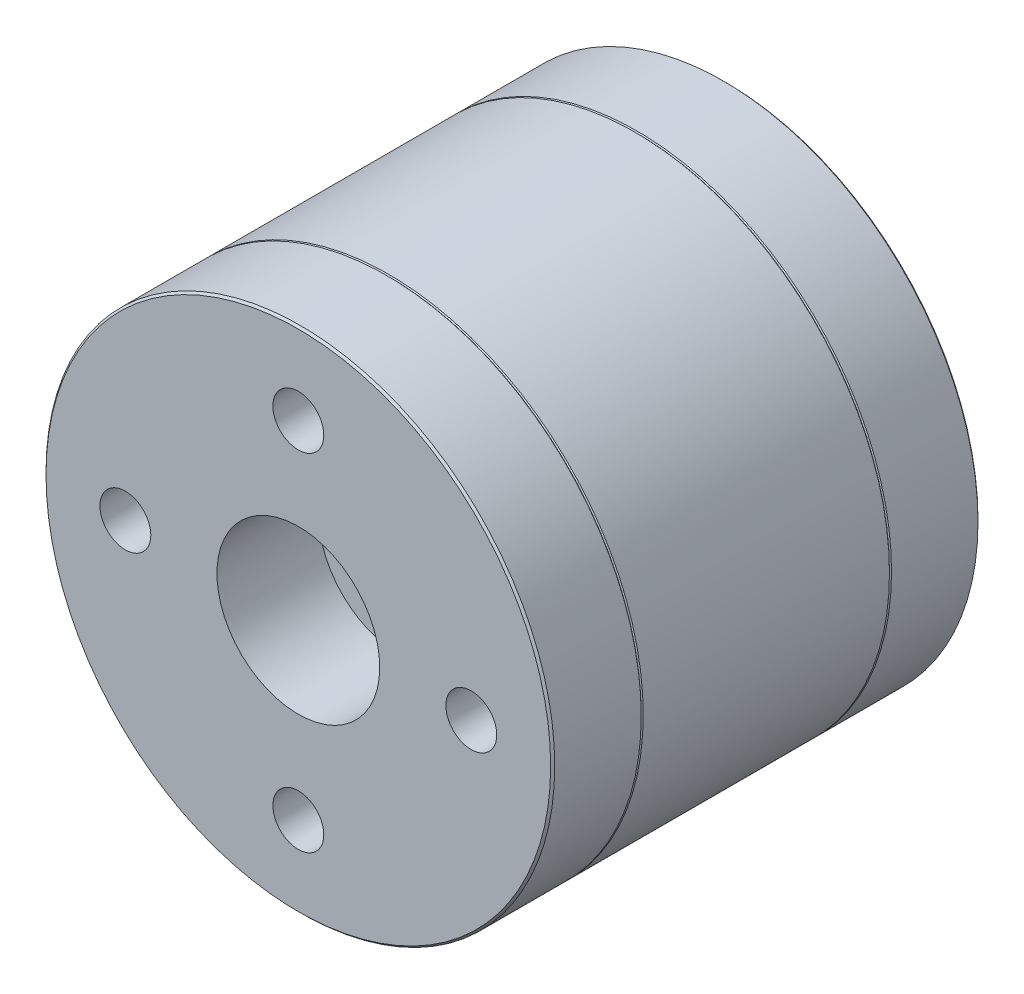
ISO-10303-21;
HEADER;
FILE_DESCRIPTION(('STEP AP214'),'2;1');
FILE_NAME('part.step','',(''),(''),'','','');
FILE_SCHEMA(('AUTOMOTIVE_DESIGN { 1 0 10303 214 1 1 1 1 }'));
ENDSEC;
DATA;
#1=APPLICATION_CONTEXT('core data for automotive mechanical design processes');
#2=APPLICATION_PROTOCOL_DEFINITION('international standard','automotive_design',2000,#1);
#3=PRODUCT_CONTEXT('',#1,'mechanical');
#4=PRODUCT('Part','Part','',(#3));
#5=PRODUCT_RELATED_PRODUCT_CATEGORY('part','',(#4));
#6=PRODUCT_DEFINITION_FORMATION('','',#4);
#7=PRODUCT_DEFINITION_CONTEXT('part definition',#1,'design');
#8=PRODUCT_DEFINITION('design','',#6,#7);
#9=PRODUCT_DEFINITION_SHAPE('','',#8);
#10=(LENGTH_UNIT() NAMED_UNIT(*) SI_UNIT(.MILLI.,.METRE.));
#11=(NAMED_UNIT(*) PLANE_ANGLE_UNIT() SI_UNIT($,.RADIAN.));
#12=(NAMED_UNIT(*) SI_UNIT($,.STERADIAN.) SOLID_ANGLE_UNIT());
#13=UNCERTAINTY_MEASURE_WITH_UNIT(LENGTH_MEASURE(1.E-05),#10,'distance_accuracy_value','');
#14=(GEOMETRIC_REPRESENTATION_CONTEXT(3) GLOBAL_UNCERTAINTY_ASSIGNED_CONTEXT((#13)) GLOBAL_UNIT_ASSIGNED_CONTEXT((#10,
#11,#12)) REPRESENTATION_CONTEXT('',''));
#15=CARTESIAN_POINT('',(0.,0.,0.));
#16=DIRECTION('',(0.,0.,1.));
#17=DIRECTION('',(1.,0.,0.));
#18=AXIS2_PLACEMENT_3D('',#15,#16,#17);
#19=CARTESIAN_POINT('',(-8.50000000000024,2.40543580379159E-13,10.501));
#20=DIRECTION('',(0.,0.,-1.));
#21=DIRECTION('',(-1.,0.,0.));
#22=AXIS2_PLACEMENT_3D('',#19,#20,#21);
#23=CYLINDRICAL_SURFACE('',#22,1.25000000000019);
#24=CARTESIAN_POINT('',(-8.50000000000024,2.40543580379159E-13,10.5));
#25=DIRECTION('',(0.,0.,1.));
#26=DIRECTION('',(1.,0.,0.));
#27=AXIS2_PLACEMENT_3D('',#24,#25,#26);
#28=CIRCLE('',#27,1.25000000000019);
#29=CARTESIAN_POINT('',(-7.25000000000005,2.40543580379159E-13,10.5));
#30=VERTEX_POINT('',#29);
#31=EDGE_CURVE('E126',#30,#30,#28,.F.);
#32=ORIENTED_EDGE('',*,*,#31,.F.);
#33=EDGE_LOOP('',(#32));
#34=FACE_BOUND('',#33,.T.);
#35=CARTESIAN_POINT('',(-8.50000000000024,2.40543580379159E-13,-7.5));
#36=DIRECTION('',(0.,0.,-1.));
#37=DIRECTION('',(-1.,0.,0.));
#38=AXIS2_PLACEMENT_3D('',#35,#36,#37);
#39=CIRCLE('',#38,1.25000000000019);
#40=CARTESIAN_POINT('',(-9.75000000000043,2.40543580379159E-13,-7.5));
#41=VERTEX_POINT('',#40);
#42=EDGE_CURVE('E54',#41,#41,#39,.F.);
#43=ORIENTED_EDGE('',*,*,#42,.F.);
#44=EDGE_LOOP('',(#43));
#45=FACE_BOUND('',#44,.T.);
#46=ADVANCED_FACE('F33',(#34,#45),#23,.F.);
#47=CARTESIAN_POINT('',(8.49999999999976,-2.41584530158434E-13,10.501));
#48=DIRECTION('',(0.,0.,-1.));
#49=DIRECTION('',(-1.,0.,0.));
#50=AXIS2_PLACEMENT_3D('',#47,#48,#49);
#51=CYLINDRICAL_SURFACE('',#50,1.25000000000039);
#52=CARTESIAN_POINT('',(8.49999999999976,-2.41584530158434E-13,10.5));
#53=DIRECTION('',(0.,0.,1.));
#54=DIRECTION('',(1.,0.,0.));
#55=AXIS2_PLACEMENT_3D('',#52,#53,#54);
#56=CIRCLE('',#55,1.25000000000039);
#57=CARTESIAN_POINT('',(9.75000000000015,-2.41584530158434E-13,10.5));
#58=VERTEX_POINT('',#57);
#59=EDGE_CURVE('E62',#58,#58,#56,.F.);
#60=ORIENTED_EDGE('',*,*,#59,.F.);
#61=EDGE_LOOP('',(#60));
#62=FACE_BOUND('',#61,.T.);
#63=CARTESIAN_POINT('',(8.49999999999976,-2.41584530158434E-13,-7.5));
#64=DIRECTION('',(0.,0.,-1.));
#65=DIRECTION('',(-1.,0.,0.));
#66=AXIS2_PLACEMENT_3D('',#63,#64,#65);
#67=CIRCLE('',#66,1.25000000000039);
#68=CARTESIAN_POINT('',(7.24999999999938,-2.41584530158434E-13,-7.5));
#69=VERTEX_POINT('',#68);
#70=EDGE_CURVE('E59',#69,#69,#67,.F.);
#71=ORIENTED_EDGE('',*,*,#70,.F.);
#72=EDGE_LOOP('',(#71));
#73=FACE_BOUND('',#72,.T.);
#74=ADVANCED_FACE('F161',(#62,#73),#51,.F.);
#75=CARTESIAN_POINT('',(0.,0.,10.501));
#76=DIRECTION('',(0.,0.,-1.));
#77=DIRECTION('',(-1.,0.,0.));
#78=AXIS2_PLACEMENT_3D('',#75,#76,#77);
#79=CYLINDRICAL_SURFACE('',#78,2.);
#80=CARTESIAN_POINT('',(0.,0.,-12.8));
#81=DIRECTION('',(0.,0.,-1.));
#82=DIRECTION('',(-1.,0.,0.));
#83=AXIS2_PLACEMENT_3D('',#80,#81,#82);
#84=CIRCLE('',#83,2.);
#85=CARTESIAN_POINT('',(-2.,0.,-12.8));
#86=VERTEX_POINT('',#85);
#87=EDGE_CURVE('E71',#86,#86,#84,.T.);
#88=ORIENTED_EDGE('',*,*,#87,.T.);
#89=EDGE_LOOP('',(#88));
#90=FACE_BOUND('',#89,.T.);
#91=CARTESIAN_POINT('',(0.,0.,5.5));
#92=DIRECTION('',(0.,0.,1.));
#93=DIRECTION('',(1.,0.,0.));
#94=AXIS2_PLACEMENT_3D('',#91,#92,#93);
#95=CIRCLE('',#94,2.);
#96=CARTESIAN_POINT('',(2.,0.,5.5));
#97=VERTEX_POINT('',#96);
#98=EDGE_CURVE('E75',#97,#97,#95,.F.);
#99=ORIENTED_EDGE('',*,*,#98,.F.);
#100=EDGE_LOOP('',(#99));
#101=FACE_BOUND('',#100,.T.);
#102=ADVANCED_FACE('F167',(#90,#101),#79,.F.);
#103=CARTESIAN_POINT('',(0.,0.,-9.5));
#104=DIRECTION('',(0.,0.,-1.));
#105=DIRECTION('',(-1.,0.,0.));
#106=AXIS2_PLACEMENT_3D('',#103,#104,#105);
#107=PLANE('',#106);
#108=CARTESIAN_POINT('',(0.,0.,-9.5));
#109=DIRECTION('',(0.,0.,-1.));
#110=DIRECTION('',(-1.,0.,0.));
#111=AXIS2_PLACEMENT_3D('',#108,#109,#110);
#112=CIRCLE('',#111,3.51);
#113=CARTESIAN_POINT('',(-3.51,0.,-9.5));
#114=VERTEX_POINT('',#113);
#115=EDGE_CURVE('E109',#114,#114,#112,.T.);
#116=ORIENTED_EDGE('',*,*,#115,.T.);
#117=EDGE_LOOP('',(#116));
#118=FACE_BOUND('',#117,.T.);
#119=CARTESIAN_POINT('',(0.,0.,-9.5));
#120=DIRECTION('',(0.,0.,-1.));
#121=DIRECTION('',(-1.,0.,0.));
#122=AXIS2_PLACEMENT_3D('',#119,#120,#121);
#123=CIRCLE('',#122,3.5);
#124=CARTESIAN_POINT('',(-3.5,0.,-9.5));
#125=VERTEX_POINT('',#124);
#126=EDGE_CURVE('E78',#125,#125,#123,.T.);
#127=ORIENTED_EDGE('',*,*,#126,.F.);
#128=EDGE_LOOP('',(#127));
#129=FACE_BOUND('',#128,.T.);
#130=ADVANCED_FACE('F192',(#118,#129),#107,.T.);
#131=CARTESIAN_POINT('',(0.,0.,10.5));
#132=DIRECTION('',(0.,0.,-1.));
#133=DIRECTION('',(-1.,0.,0.));
#134=AXIS2_PLACEMENT_3D('',#131,#132,#133);
#135=CYLINDRICAL_SURFACE('',#134,12.5);
#136=CARTESIAN_POINT('',(0.,0.,6.05));
#137=DIRECTION('',(0.,0.,1.));
#138=DIRECTION('',(1.,0.,0.));
#139=AXIS2_PLACEMENT_3D('',#136,#137,#138);
#140=CIRCLE('',#139,12.5);
#141=CARTESIAN_POINT('',(-12.5,0.,6.05));
#142=VERTEX_POINT('',#141);
#143=EDGE_CURVE('E94',#142,#142,#140,.T.);
#144=CARTESIAN_POINT('',(0.,0.,-6.05));
#145=DIRECTION('',(0.,0.,1.));
#146=DIRECTION('',(1.,0.,0.));
#147=AXIS2_PLACEMENT_3D('',#144,#145,#146);
#148=CIRCLE('',#147,12.5);
#149=CARTESIAN_POINT('',(-12.5,0.,-6.05000000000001));
#150=VERTEX_POINT('',#149);
#151=EDGE_CURVE('E106',#150,#150,#148,.T.);
#152=CARTESIAN_POINT('',(-12.5,0.,6.05));
#153=CARTESIAN_POINT('',(-12.5,0.,5.92395833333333));
#154=CARTESIAN_POINT('',(-12.5,0.,5.79791666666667));
#155=CARTESIAN_POINT('',(-12.5,0.,5.54583333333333));
#156=CARTESIAN_POINT('',(-12.5,0.,5.41979166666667));
#157=CARTESIAN_POINT('',(-12.5,0.,5.16770833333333));
#158=CARTESIAN_POINT('',(-12.5,0.,5.04166666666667));
#159=CARTESIAN_POINT('',(-12.5,0.,4.78958333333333));
#160=CARTESIAN_POINT('',(-12.5,0.,4.66354166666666));
#161=CARTESIAN_POINT('',(-12.5,0.,4.41145833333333));
#162=CARTESIAN_POINT('',(-12.5,0.,4.28541666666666));
#163=CARTESIAN_POINT('',(-12.5,0.,4.03333333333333));
#164=CARTESIAN_POINT('',(-12.5,0.,3.90729166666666));
#165=CARTESIAN_POINT('',(-12.5,0.,3.65520833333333));
#166=CARTESIAN_POINT('',(-12.5,0.,3.52916666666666));
#167=CARTESIAN_POINT('',(-12.5,0.,3.27708333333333));
#168=CARTESIAN_POINT('',(-12.5,0.,3.15104166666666));
#169=CARTESIAN_POINT('',(-12.5,0.,2.89895833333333));
#170=CARTESIAN_POINT('',(-12.5,0.,2.77291666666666));
#171=CARTESIAN_POINT('',(-12.5,0.,2.52083333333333));
#172=CARTESIAN_POINT('',(-12.5,0.,2.39479166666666));
#173=CARTESIAN_POINT('',(-12.5,0.,2.14270833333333));
#174=CARTESIAN_POINT('',(-12.5,0.,2.01666666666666));
#175=CARTESIAN_POINT('',(-12.5,0.,1.76458333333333));
#176=CARTESIAN_POINT('',(-12.5,0.,1.63854166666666));
#177=CARTESIAN_POINT('',(-12.5,0.,1.38645833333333));
#178=CARTESIAN_POINT('',(-12.5,0.,1.26041666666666));
#179=CARTESIAN_POINT('',(-12.5,0.,1.00833333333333));
#180=CARTESIAN_POINT('',(-12.5,0.,0.882291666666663));
#181=CARTESIAN_POINT('',(-12.5,0.,0.63020833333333));
#182=CARTESIAN_POINT('',(-12.5,0.,0.504166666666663));
#183=CARTESIAN_POINT('',(-12.5,0.,0.25208333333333));
#184=CARTESIAN_POINT('',(-12.5,0.,0.126041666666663));
#185=CARTESIAN_POINT('',(-12.5,0.,-0.12604166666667));
#186=CARTESIAN_POINT('',(-12.5,0.,-0.252083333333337));
#187=CARTESIAN_POINT('',(-12.5,0.,-0.50416666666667));
#188=CARTESIAN_POINT('',(-12.5,0.,-0.630208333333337));
#189=CARTESIAN_POINT('',(-12.5,0.,-0.88229166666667));
#190=CARTESIAN_POINT('',(-12.5,0.,-1.00833333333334));
#191=CARTESIAN_POINT('',(-12.5,0.,-1.26041666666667));
#192=CARTESIAN_POINT('',(-12.5,0.,-1.38645833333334));
#193=CARTESIAN_POINT('',(-12.5,0.,-1.63854166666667));
#194=CARTESIAN_POINT('',(-12.5,0.,-1.76458333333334));
#195=CARTESIAN_POINT('',(-12.5,0.,-2.01666666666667));
#196=CARTESIAN_POINT('',(-12.5,0.,-2.14270833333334));
#197=CARTESIAN_POINT('',(-12.5,0.,-2.39479166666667));
#198=CARTESIAN_POINT('',(-12.5,0.,-2.52083333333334));
#199=CARTESIAN_POINT('',(-12.5,0.,-2.77291666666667));
#200=CARTESIAN_POINT('',(-12.5,0.,-2.89895833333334));
#201=CARTESIAN_POINT('',(-12.5,0.,-3.15104166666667));
#202=CARTESIAN_POINT('',(-12.5,0.,-3.27708333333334));
#203=CARTESIAN_POINT('',(-12.5,0.,-3.52916666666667));
#204=CARTESIAN_POINT('',(-12.5,0.,-3.65520833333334));
#205=CARTESIAN_POINT('',(-12.5,0.,-3.90729166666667));
#206=CARTESIAN_POINT('',(-12.5,0.,-4.03333333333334));
#207=CARTESIAN_POINT('',(-12.5,0.,-4.28541666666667));
#208=CARTESIAN_POINT('',(-12.5,0.,-4.41145833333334));
#209=CARTESIAN_POINT('',(-12.5,0.,-4.66354166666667));
#210=CARTESIAN_POINT('',(-12.5,0.,-4.78958333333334));
#211=CARTESIAN_POINT('',(-12.5,0.,-5.04166666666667));
#212=CARTESIAN_POINT('',(-12.5,0.,-5.16770833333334));
#213=CARTESIAN_POINT('',(-12.5,0.,-5.41979166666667));
#214=CARTESIAN_POINT('',(-12.5,0.,-5.54583333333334));
#215=CARTESIAN_POINT('',(-12.5,0.,-5.79791666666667));
#216=CARTESIAN_POINT('',(-12.5,0.,-5.92395833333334));
#217=CARTESIAN_POINT('',(-12.5,0.,-6.05000000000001));
#218=B_SPLINE_CURVE_WITH_KNOTS('',3,(#152,#153,#154,#155,#156,#157,#158,#159,#160,#161,#162,
#163,#164,#165,#166,#167,#168,#169,#170,#171,#172,#173,#174,#175,#176,#177,#178,#179,#180,#181,
#182,#183,#184,#185,#186,#187,#188,#189,#190,#191,#192,#193,#194,#195,#196,#197,#198,#199,#200,
#201,#202,#203,#204,#205,#206,#207,#208,#209,#210,#211,#212,#213,#214,#215,#216,#217),
.UNSPECIFIED.,.F.,.F.,(4,2,2,2,2,2,2,2,2,2,2,2,2,2,2,2,2,2,2,2,2,2,2,2,2,2,2,2,2,2,2,2,4),(0.,
0.378125,0.75625,1.134375,1.5125,1.890625,2.26875,2.646875,3.025,3.403125,3.78125,4.159375,
4.5375,4.915625,5.29375,5.671875,6.05,6.428125,6.80625,7.184375,7.5625,7.940625,8.31875,
8.696875,9.075,9.453125,9.83125,10.209375,10.5875,10.965625,11.34375,11.721875,12.1),.UNSPECIFIED.);
#219=EDGE_CURVE('BSEAM204',#142,#150,#218,.T.);
#220=ORIENTED_EDGE('',*,*,#143,.F.);
#221=ORIENTED_EDGE('',*,*,#151,.T.);
#222=ORIENTED_EDGE('',*,*,#219,.T.);
#223=ORIENTED_EDGE('',*,*,#219,.F.);
#224=EDGE_LOOP('',(#220,#222,#221,#223));
#225=FACE_BOUND('',#224,.T.);
#226=ADVANCED_FACE('F204',(#225),#135,.T.);
#227=CARTESIAN_POINT('',(0.,0.,10.4));
#228=DIRECTION('',(0.,0.,1.));
#229=DIRECTION('',(1.,0.,0.));
#230=AXIS2_PLACEMENT_3D('',#227,#228,#229);
#231=CIRCLE('',#230,12.5);
#232=CARTESIAN_POINT('',(-12.5,0.,10.4));
#233=VERTEX_POINT('',#232);
#234=EDGE_CURVE('E85',#233,#233,#231,.F.);
#235=CARTESIAN_POINT('',(0.,0.,6.15));
#236=DIRECTION('',(0.,0.,1.));
#237=DIRECTION('',(1.,0.,0.));
#238=AXIS2_PLACEMENT_3D('',#235,#236,#237);
#239=CIRCLE('',#238,12.5);
#240=CARTESIAN_POINT('',(-12.5,0.,6.15));
#241=VERTEX_POINT('',#240);
#242=EDGE_CURVE('E97',#241,#241,#239,.T.);
#243=CARTESIAN_POINT('',(-12.5,0.,10.4));
#244=CARTESIAN_POINT('',(-12.5,0.,10.3557291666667));
#245=CARTESIAN_POINT('',(-12.5,0.,10.3114583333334));
#246=CARTESIAN_POINT('',(-12.5,0.,10.2229166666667));
#247=CARTESIAN_POINT('',(-12.5,0.,10.1786458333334));
#248=CARTESIAN_POINT('',(-12.5,0.,10.0901041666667));
#249=CARTESIAN_POINT('',(-12.5,0.,10.0458333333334));
#250=CARTESIAN_POINT('',(-12.5,0.,9.95729166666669));
#251=CARTESIAN_POINT('',(-12.5,0.,9.91302083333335));
#252=CARTESIAN_POINT('',(-12.5,0.,9.82447916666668));
#253=CARTESIAN_POINT('',(-12.5,0.,9.78020833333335));
#254=CARTESIAN_POINT('',(-12.5,0.,9.69166666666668));
#255=CARTESIAN_POINT('',(-12.5,0.,9.64739583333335));
#256=CARTESIAN_POINT('',(-12.5,0.,9.55885416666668));
#257=CARTESIAN_POINT('',(-12.5,0.,9.51458333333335));
#258=CARTESIAN_POINT('',(-12.5,0.,9.42604166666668));
#259=CARTESIAN_POINT('',(-12.5,0.,9.38177083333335));
#260=CARTESIAN_POINT('',(-12.5,0.,9.29322916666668));
#261=CARTESIAN_POINT('',(-12.5,0.,9.24895833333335));
#262=CARTESIAN_POINT('',(-12.5,0.,9.16041666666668));
#263=CARTESIAN_POINT('',(-12.5,0.,9.11614583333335));
#264=CARTESIAN_POINT('',(-12.5,0.,9.02760416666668));
#265=CARTESIAN_POINT('',(-12.5,0.,8.98333333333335));
#266=CARTESIAN_POINT('',(-12.5,0.,8.89479166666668));
#267=CARTESIAN_POINT('',(-12.5,0.,8.85052083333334));
#268=CARTESIAN_POINT('',(-12.5,0.,8.76197916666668));
#269=CARTESIAN_POINT('',(-12.5,0.,8.71770833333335));
#270=CARTESIAN_POINT('',(-12.5,0.,8.62916666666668));
#271=CARTESIAN_POINT('',(-12.5,0.,8.58489583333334));
#272=CARTESIAN_POINT('',(-12.5,0.,8.49635416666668));
#273=CARTESIAN_POINT('',(-12.5,0.,8.45208333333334));
#274=CARTESIAN_POINT('',(-12.5,0.,8.36354166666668));
#275=CARTESIAN_POINT('',(-12.5,0.,8.31927083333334));
#276=CARTESIAN_POINT('',(-12.5,0.,8.23072916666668));
#277=CARTESIAN_POINT('',(-12.5,0.,8.18645833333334));
#278=CARTESIAN_POINT('',(-12.5,0.,8.09791666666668));
#279=CARTESIAN_POINT('',(-12.5,0.,8.05364583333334));
#280=CARTESIAN_POINT('',(-12.5,0.,7.96510416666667));
#281=CARTESIAN_POINT('',(-12.5,0.,7.92083333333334));
#282=CARTESIAN_POINT('',(-12.5,0.,7.83229166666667));
#283=CARTESIAN_POINT('',(-12.5,0.,7.78802083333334));
#284=CARTESIAN_POINT('',(-12.5,0.,7.69947916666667));
#285=CARTESIAN_POINT('',(-12.5,0.,7.65520833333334));
#286=CARTESIAN_POINT('',(-12.5,0.,7.56666666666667));
#287=CARTESIAN_POINT('',(-12.5,0.,7.52239583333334));
#288=CARTESIAN_POINT('',(-12.5,0.,7.43385416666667));
#289=CARTESIAN_POINT('',(-12.5,0.,7.38958333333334));
#290=CARTESIAN_POINT('',(-12.5,0.,7.30104166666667));
#291=CARTESIAN_POINT('',(-12.5,0.,7.25677083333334));
#292=CARTESIAN_POINT('',(-12.5,0.,7.16822916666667));
#293=CARTESIAN_POINT('',(-12.5,0.,7.12395833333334));
#294=CARTESIAN_POINT('',(-12.5,0.,7.03541666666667));
#295=CARTESIAN_POINT('',(-12.5,0.,6.99114583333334));
#296=CARTESIAN_POINT('',(-12.5,0.,6.90260416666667));
#297=CARTESIAN_POINT('',(-12.5,0.,6.85833333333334));
#298=CARTESIAN_POINT('',(-12.5,0.,6.76979166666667));
#299=CARTESIAN_POINT('',(-12.5,0.,6.72552083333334));
#300=CARTESIAN_POINT('',(-12.5,0.,6.63697916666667));
#301=CARTESIAN_POINT('',(-12.5,0.,6.59270833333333));
#302=CARTESIAN_POINT('',(-12.5,0.,6.50416666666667));
#303=CARTESIAN_POINT('',(-12.5,0.,6.45989583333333));
#304=CARTESIAN_POINT('',(-12.5,0.,6.37135416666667));
#305=CARTESIAN_POINT('',(-12.5,0.,6.32708333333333));
#306=CARTESIAN_POINT('',(-12.5,0.,6.23854166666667));
#307=CARTESIAN_POINT('',(-12.5,0.,6.19427083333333));
#308=CARTESIAN_POINT('',(-12.5,0.,6.15));
#309=B_SPLINE_CURVE_WITH_KNOTS('',3,(#243,#244,#245,#246,#247,#248,#249,#250,#251,#252,#253,
#254,#255,#256,#257,#258,#259,#260,#261,#262,#263,#264,#265,#266,#267,#268,#269,#270,#271,#272,
#273,#274,#275,#276,#277,#278,#279,#280,#281,#282,#283,#284,#285,#286,#287,#288,#289,#290,#291,
#292,#293,#294,#295,#296,#297,#298,#299,#300,#301,#302,#303,#304,#305,#306,#307,#308),
.UNSPECIFIED.,.F.,.F.,(4,2,2,2,2,2,2,2,2,2,2,2,2,2,2,2,2,2,2,2,2,2,2,2,2,2,2,2,2,2,2,2,4),(0.,
0.132812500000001,0.265625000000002,0.398437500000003,0.531250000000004,0.664062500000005,
0.796875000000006,0.929687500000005,1.06250000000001,1.19531250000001,1.32812500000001,
1.46093750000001,1.59375000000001,1.72656250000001,1.85937500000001,1.99218750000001,
2.12500000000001,2.25781250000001,2.39062500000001,2.52343750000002,2.65625000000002,
2.78906250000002,2.92187500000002,3.05468750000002,3.18750000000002,3.32031250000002,
3.45312500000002,3.58593750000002,3.71875000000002,3.85156250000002,3.98437500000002,
4.11718750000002,4.25000000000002),.UNSPECIFIED.);
#310=EDGE_CURVE('BSEAM230',#233,#241,#309,.T.);
#311=ORIENTED_EDGE('',*,*,#234,.T.);
#312=ORIENTED_EDGE('',*,*,#242,.T.);
#313=ORIENTED_EDGE('',*,*,#310,.T.);
#314=ORIENTED_EDGE('',*,*,#310,.F.);
#315=EDGE_LOOP('',(#311,#313,#312,#314));
#316=FACE_BOUND('',#315,.T.);
#317=ADVANCED_FACE('F230',(#316),#135,.T.);
#318=CARTESIAN_POINT('',(0.,0.,10.5));
#319=DIRECTION('',(0.,0.,1.));
#320=DIRECTION('',(1.,0.,0.));
#321=AXIS2_PLACEMENT_3D('',#318,#319,#320);
#322=PLANE('',#321);
#323=ORIENTED_EDGE('',*,*,#59,.T.);
#324=EDGE_LOOP('',(#323));
#325=FACE_BOUND('',#324,.T.);
#326=CARTESIAN_POINT('',(-4.81087160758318E-13,-8.5,10.5));
#327=DIRECTION('',(0.,0.,1.));
#328=DIRECTION('',(1.,0.,0.));
#329=AXIS2_PLACEMENT_3D('',#326,#327,#328);
#330=CIRCLE('',#329,1.25000000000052);
#331=CARTESIAN_POINT('',(1.25000000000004,-8.5,10.5));
#332=VERTEX_POINT('',#331);
#333=EDGE_CURVE('E132',#332,#332,#330,.F.);
#334=ORIENTED_EDGE('',*,*,#333,.T.);
#335=EDGE_LOOP('',(#334));
#336=FACE_BOUND('',#335,.T.);
#337=ORIENTED_EDGE('',*,*,#31,.T.);
#338=EDGE_LOOP('',(#337));
#339=FACE_BOUND('',#338,.T.);
#340=CARTESIAN_POINT('',(0.,8.5,10.5));
#341=DIRECTION('',(0.,0.,1.));
#342=DIRECTION('',(1.,0.,0.));
#343=AXIS2_PLACEMENT_3D('',#340,#341,#342);
#344=CIRCLE('',#343,1.25);
#345=CARTESIAN_POINT('',(1.25,8.5,10.5));
#346=VERTEX_POINT('',#345);
#347=EDGE_CURVE('E123',#346,#346,#344,.F.);
#348=ORIENTED_EDGE('',*,*,#347,.T.);
#349=EDGE_LOOP('',(#348));
#350=FACE_BOUND('',#349,.T.);
#351=CARTESIAN_POINT('',(0.,0.,10.5));
#352=DIRECTION('',(0.,0.,1.));
#353=DIRECTION('',(1.,0.,0.));
#354=AXIS2_PLACEMENT_3D('',#351,#352,#353);
#355=CIRCLE('',#354,4.);
#356=CARTESIAN_POINT('',(4.,0.,10.5));
#357=VERTEX_POINT('',#356);
#358=EDGE_CURVE('E117',#357,#357,#355,.T.);
#359=ORIENTED_EDGE('',*,*,#358,.F.);
#360=EDGE_LOOP('',(#359));
#361=FACE_BOUND('',#360,.T.);
#362=CARTESIAN_POINT('',(0.,0.,10.5));
#363=DIRECTION('',(0.,0.,1.));
#364=DIRECTION('',(1.,0.,0.));
#365=AXIS2_PLACEMENT_3D('',#362,#363,#364);
#366=CIRCLE('',#365,12.4);
#367=CARTESIAN_POINT('',(12.4,0.,10.5));
#368=VERTEX_POINT('',#367);
#369=EDGE_CURVE('E88',#368,#368,#366,.T.);
#370=ORIENTED_EDGE('',*,*,#369,.T.);
#371=EDGE_LOOP('',(#370));
#372=FACE_BOUND('',#371,.T.);
#373=ADVANCED_FACE('F226',(#325,#336,#339,#350,#361,#372),#322,.T.);
#374=CARTESIAN_POINT('',(0.,0.,6.15));
#375=DIRECTION('',(0.,0.,1.));
#376=DIRECTION('',(1.,0.,0.));
#377=AXIS2_PLACEMENT_3D('',#374,#375,#376);
#378=CONICAL_SURFACE('',#377,12.5,0.785398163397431);
#379=CARTESIAN_POINT('',(0.,0.,6.1));
#380=DIRECTION('',(0.,0.,1.));
#381=DIRECTION('',(1.,0.,0.));
#382=AXIS2_PLACEMENT_3D('',#379,#380,#381);
#383=CIRCLE('',#382,12.45);
#384=CARTESIAN_POINT('',(12.45,0.,6.1));
#385=VERTEX_POINT('',#384);
#386=EDGE_CURVE('E91',#385,#385,#383,.T.);
#387=ORIENTED_EDGE('',*,*,#386,.T.);
#388=EDGE_LOOP('',(#387));
#389=FACE_BOUND('',#388,.T.);
#390=ORIENTED_EDGE('',*,*,#242,.F.);
#391=EDGE_LOOP('',(#390));
#392=FACE_BOUND('',#391,.T.);
#393=ADVANCED_FACE('F222',(#389,#392),#378,.T.);
#394=CARTESIAN_POINT('',(0.,0.,6.1));
#395=DIRECTION('',(0.,0.,-1.));
#396=DIRECTION('',(-1.,0.,0.));
#397=AXIS2_PLACEMENT_3D('',#394,#395,#396);
#398=CONICAL_SURFACE('',#397,12.45,0.785398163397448);
#399=ORIENTED_EDGE('',*,*,#143,.T.);
#400=EDGE_LOOP('',(#399));
#401=FACE_BOUND('',#400,.T.);
#402=ORIENTED_EDGE('',*,*,#386,.F.);
#403=EDGE_LOOP('',(#402));
#404=FACE_BOUND('',#403,.T.);
#405=ADVANCED_FACE('F218',(#401,#404),#398,.T.);
#406=CARTESIAN_POINT('',(0.,0.,-6.05));
#407=DIRECTION('',(0.,0.,1.));
#408=DIRECTION('',(1.,0.,0.));
#409=AXIS2_PLACEMENT_3D('',#406,#407,#408);
#410=CONICAL_SURFACE('',#409,12.5,0.785398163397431);
#411=CARTESIAN_POINT('',(0.,0.,-6.1));
#412=DIRECTION('',(0.,0.,1.));
#413=DIRECTION('',(1.,0.,0.));
#414=AXIS2_PLACEMENT_3D('',#411,#412,#413);
#415=CIRCLE('',#414,12.45);
#416=CARTESIAN_POINT('',(12.45,0.,-6.1));
#417=VERTEX_POINT('',#416);
#418=EDGE_CURVE('E100',#417,#417,#415,.T.);
#419=ORIENTED_EDGE('',*,*,#418,.T.);
#420=EDGE_LOOP('',(#419));
#421=FACE_BOUND('',#420,.T.);
#422=ORIENTED_EDGE('',*,*,#151,.F.);
#423=EDGE_LOOP('',(#422));
#424=FACE_BOUND('',#423,.T.);
#425=ADVANCED_FACE('F214',(#421,#424),#410,.T.);
#426=CARTESIAN_POINT('',(0.,0.,-6.1));
#427=DIRECTION('',(0.,0.,-1.));
#428=DIRECTION('',(-1.,0.,0.));
#429=AXIS2_PLACEMENT_3D('',#426,#427,#428);
#430=CONICAL_SURFACE('',#429,12.45,0.785398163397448);
#431=CARTESIAN_POINT('',(0.,0.,-6.15));
#432=DIRECTION('',(0.,0.,1.));
#433=DIRECTION('',(1.,0.,0.));
#434=AXIS2_PLACEMENT_3D('',#431,#432,#433);
#435=CIRCLE('',#434,12.5);
#436=CARTESIAN_POINT('',(-12.5,0.,-6.15));
#437=VERTEX_POINT('',#436);
#438=EDGE_CURVE('E103',#437,#437,#435,.T.);
#439=ORIENTED_EDGE('',*,*,#438,.T.);
#440=EDGE_LOOP('',(#439));
#441=FACE_BOUND('',#440,.T.);
#442=ORIENTED_EDGE('',*,*,#418,.F.);
#443=EDGE_LOOP('',(#442));
#444=FACE_BOUND('',#443,.T.);
#445=ADVANCED_FACE('F210',(#441,#444),#430,.T.);
#446=CARTESIAN_POINT('',(0.,0.,-10.5));
#447=DIRECTION('',(0.,0.,1.));
#448=DIRECTION('',(1.,0.,0.));
#449=AXIS2_PLACEMENT_3D('',#446,#447,#448);
#450=PLANE('',#449);
#451=CARTESIAN_POINT('',(-8.50000000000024,2.40543580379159E-13,-10.5));
#452=DIRECTION('',(0.,0.,1.));
#453=DIRECTION('',(1.,0.,0.));
#454=AXIS2_PLACEMENT_3D('',#451,#452,#453);
#455=CIRCLE('',#454,2.75000000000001);
#456=CARTESIAN_POINT('',(-5.75000000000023,2.40543580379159E-13,-10.5));
#457=VERTEX_POINT('',#456);
#458=EDGE_CURVE('E40',#457,#457,#455,.T.);
#459=ORIENTED_EDGE('',*,*,#458,.T.);
#460=EDGE_LOOP('',(#459));
#461=FACE_BOUND('',#460,.T.);
#462=CARTESIAN_POINT('',(8.49999999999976,-2.41584530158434E-13,-10.5));
#463=DIRECTION('',(0.,0.,1.));
#464=DIRECTION('',(1.,0.,0.));
#465=AXIS2_PLACEMENT_3D('',#462,#463,#464);
#466=CIRCLE('',#465,2.75);
#467=CARTESIAN_POINT('',(11.2499999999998,-2.41584530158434E-13,-10.5));
#468=VERTEX_POINT('',#467);
#469=EDGE_CURVE('E44',#468,#468,#466,.T.);
#470=ORIENTED_EDGE('',*,*,#469,.T.);
#471=EDGE_LOOP('',(#470));
#472=FACE_BOUND('',#471,.T.);
#473=CARTESIAN_POINT('',(-4.81087160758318E-13,-8.5,-10.5));
#474=DIRECTION('',(0.,0.,-1.));
#475=DIRECTION('',(-1.,0.,0.));
#476=AXIS2_PLACEMENT_3D('',#473,#474,#475);
#477=CIRCLE('',#476,1.25000000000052);
#478=CARTESIAN_POINT('',(-1.250000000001,-8.5,-10.5));
#479=VERTEX_POINT('',#478);
#480=EDGE_CURVE('E131',#479,#479,#477,.T.);
#481=ORIENTED_EDGE('',*,*,#480,.F.);
#482=EDGE_LOOP('',(#481));
#483=FACE_BOUND('',#482,.T.);
#484=CARTESIAN_POINT('',(0.,8.5,-10.5));
#485=DIRECTION('',(0.,0.,-1.));
#486=DIRECTION('',(-1.,0.,0.));
#487=AXIS2_PLACEMENT_3D('',#484,#485,#486);
#488=CIRCLE('',#487,1.25);
#489=CARTESIAN_POINT('',(-1.25,8.5,-10.5));
#490=VERTEX_POINT('',#489);
#491=EDGE_CURVE('E120',#490,#490,#488,.T.);
#492=ORIENTED_EDGE('',*,*,#491,.F.);
#493=EDGE_LOOP('',(#492));
#494=FACE_BOUND('',#493,.T.);
#495=CARTESIAN_POINT('',(0.,0.,-10.5));
#496=DIRECTION('',(0.,0.,-1.));
#497=DIRECTION('',(-1.,0.,0.));
#498=AXIS2_PLACEMENT_3D('',#495,#496,#497);
#499=CIRCLE('',#498,3.51);
#500=CARTESIAN_POINT('',(-3.51,0.,-10.5));
#501=VERTEX_POINT('',#500);
#502=EDGE_CURVE('E110',#501,#501,#499,.T.);
#503=ORIENTED_EDGE('',*,*,#502,.F.);
#504=EDGE_LOOP('',(#503));
#505=FACE_BOUND('',#504,.T.);
#506=CARTESIAN_POINT('',(0.,0.,-10.5));
#507=DIRECTION('',(0.,0.,1.));
#508=DIRECTION('',(1.,0.,0.));
#509=AXIS2_PLACEMENT_3D('',#506,#507,#508);
#510=CIRCLE('',#509,12.4);
#511=CARTESIAN_POINT('',(12.4,0.,-10.5));
#512=VERTEX_POINT('',#511);
#513=EDGE_CURVE('E74',#512,#512,#510,.F.);
#514=ORIENTED_EDGE('',*,*,#513,.T.);
#515=EDGE_LOOP('',(#514));
#516=FACE_BOUND('',#515,.T.);
#517=ADVANCED_FACE('F213',(#461,#472,#483,#494,#505,#516),#450,.F.);
#518=CARTESIAN_POINT('',(0.,0.,-10.4));
#519=DIRECTION('',(0.,0.,1.));
#520=DIRECTION('',(1.,0.,0.));
#521=AXIS2_PLACEMENT_3D('',#518,#519,#520);
#522=CIRCLE('',#521,12.5);
#523=CARTESIAN_POINT('',(-12.5,0.,-10.4));
#524=VERTEX_POINT('',#523);
#525=EDGE_CURVE('E82',#524,#524,#522,.T.);
#526=CARTESIAN_POINT('',(-12.5,0.,-10.4));
#527=CARTESIAN_POINT('',(-12.5,0.,-10.3557291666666));
#528=CARTESIAN_POINT('',(-12.5,0.,-10.3114583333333));
#529=CARTESIAN_POINT('',(-12.5,0.,-10.2229166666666));
#530=CARTESIAN_POINT('',(-12.5,0.,-10.1786458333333));
#531=CARTESIAN_POINT('',(-12.5,0.,-10.0901041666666));
#532=CARTESIAN_POINT('',(-12.5,0.,-10.0458333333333));
#533=CARTESIAN_POINT('',(-12.5,0.,-9.95729166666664));
#534=CARTESIAN_POINT('',(-12.5,0.,-9.91302083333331));
#535=CARTESIAN_POINT('',(-12.5,0.,-9.82447916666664));
#536=CARTESIAN_POINT('',(-12.5,0.,-9.78020833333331));
#537=CARTESIAN_POINT('',(-12.5,0.,-9.69166666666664));
#538=CARTESIAN_POINT('',(-12.5,0.,-9.64739583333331));
#539=CARTESIAN_POINT('',(-12.5,0.,-9.55885416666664));
#540=CARTESIAN_POINT('',(-12.5,0.,-9.51458333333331));
#541=CARTESIAN_POINT('',(-12.5,0.,-9.42604166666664));
#542=CARTESIAN_POINT('',(-12.5,0.,-9.38177083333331));
#543=CARTESIAN_POINT('',(-12.5,0.,-9.29322916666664));
#544=CARTESIAN_POINT('',(-12.5,0.,-9.24895833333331));
#545=CARTESIAN_POINT('',(-12.5,0.,-9.16041666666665));
#546=CARTESIAN_POINT('',(-12.5,0.,-9.11614583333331));
#547=CARTESIAN_POINT('',(-12.5,0.,-9.02760416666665));
#548=CARTESIAN_POINT('',(-12.5,0.,-8.98333333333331));
#549=CARTESIAN_POINT('',(-12.5,0.,-8.89479166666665));
#550=CARTESIAN_POINT('',(-12.5,0.,-8.85052083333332));
#551=CARTESIAN_POINT('',(-12.5,0.,-8.76197916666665));
#552=CARTESIAN_POINT('',(-12.5,0.,-8.71770833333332));
#553=CARTESIAN_POINT('',(-12.5,0.,-8.62916666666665));
#554=CARTESIAN_POINT('',(-12.5,0.,-8.58489583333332));
#555=CARTESIAN_POINT('',(-12.5,0.,-8.49635416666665));
#556=CARTESIAN_POINT('',(-12.5,0.,-8.45208333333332));
#557=CARTESIAN_POINT('',(-12.5,0.,-8.36354166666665));
#558=CARTESIAN_POINT('',(-12.5,0.,-8.31927083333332));
#559=CARTESIAN_POINT('',(-12.5,0.,-8.23072916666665));
#560=CARTESIAN_POINT('',(-12.5,0.,-8.18645833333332));
#561=CARTESIAN_POINT('',(-12.5,0.,-8.09791666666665));
#562=CARTESIAN_POINT('',(-12.5,0.,-8.05364583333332));
#563=CARTESIAN_POINT('',(-12.5,0.,-7.96510416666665));
#564=CARTESIAN_POINT('',(-12.5,0.,-7.92083333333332));
#565=CARTESIAN_POINT('',(-12.5,0.,-7.83229166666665));
#566=CARTESIAN_POINT('',(-12.5,0.,-7.78802083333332));
#567=CARTESIAN_POINT('',(-12.5,0.,-7.69947916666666));
#568=CARTESIAN_POINT('',(-12.5,0.,-7.65520833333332));
#569=CARTESIAN_POINT('',(-12.5,0.,-7.56666666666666));
#570=CARTESIAN_POINT('',(-12.5,0.,-7.52239583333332));
#571=CARTESIAN_POINT('',(-12.5,0.,-7.43385416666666));
#572=CARTESIAN_POINT('',(-12.5,0.,-7.38958333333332));
#573=CARTESIAN_POINT('',(-12.5,0.,-7.30104166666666));
#574=CARTESIAN_POINT('',(-12.5,0.,-7.25677083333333));
#575=CARTESIAN_POINT('',(-12.5,0.,-7.16822916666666));
#576=CARTESIAN_POINT('',(-12.5,0.,-7.12395833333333));
#577=CARTESIAN_POINT('',(-12.5,0.,-7.03541666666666));
#578=CARTESIAN_POINT('',(-12.5,0.,-6.99114583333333));
#579=CARTESIAN_POINT('',(-12.5,0.,-6.90260416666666));
#580=CARTESIAN_POINT('',(-12.5,0.,-6.85833333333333));
#581=CARTESIAN_POINT('',(-12.5,0.,-6.76979166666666));
#582=CARTESIAN_POINT('',(-12.5,0.,-6.72552083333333));
#583=CARTESIAN_POINT('',(-12.5,0.,-6.63697916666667));
#584=CARTESIAN_POINT('',(-12.5,0.,-6.59270833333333));
#585=CARTESIAN_POINT('',(-12.5,0.,-6.50416666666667));
#586=CARTESIAN_POINT('',(-12.5,0.,-6.45989583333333));
#587=CARTESIAN_POINT('',(-12.5,0.,-6.37135416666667));
#588=CARTESIAN_POINT('',(-12.5,0.,-6.32708333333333));
#589=CARTESIAN_POINT('',(-12.5,0.,-6.23854166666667));
#590=CARTESIAN_POINT('',(-12.5,0.,-6.19427083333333));
#591=CARTESIAN_POINT('',(-12.5,0.,-6.15));
#592=B_SPLINE_CURVE_WITH_KNOTS('',3,(#526,#527,#528,#529,#530,#531,#532,#533,#534,#535,#536,
#537,#538,#539,#540,#541,#542,#543,#544,#545,#546,#547,#548,#549,#550,#551,#552,#553,#554,#555,
#556,#557,#558,#559,#560,#561,#562,#563,#564,#565,#566,#567,#568,#569,#570,#571,#572,#573,#574,
#575,#576,#577,#578,#579,#580,#581,#582,#583,#584,#585,#586,#587,#588,#589,#590,#591),
.UNSPECIFIED.,.F.,.F.,(4,2,2,2,2,2,2,2,2,2,2,2,2,2,2,2,2,2,2,2,2,2,2,2,2,2,2,2,2,2,2,2,4),(0.,
0.132812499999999,0.265624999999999,0.398437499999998,0.531249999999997,0.664062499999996,
0.796874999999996,0.929687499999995,1.06249999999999,1.19531249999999,1.32812499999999,
1.46093749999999,1.59374999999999,1.72656249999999,1.85937499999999,1.99218749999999,
2.12499999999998,2.25781249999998,2.39062499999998,2.52343749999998,2.65624999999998,
2.78906249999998,2.92187499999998,3.05468749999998,3.18749999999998,3.32031249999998,
3.45312499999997,3.58593749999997,3.71874999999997,3.85156249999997,3.98437499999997,
4.11718749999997,4.24999999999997),.UNSPECIFIED.);
#593=EDGE_CURVE('BSEAM234',#524,#437,#592,.T.);
#594=ORIENTED_EDGE('',*,*,#525,.T.);
#595=ORIENTED_EDGE('',*,*,#438,.F.);
#596=ORIENTED_EDGE('',*,*,#593,.T.);
#597=ORIENTED_EDGE('',*,*,#593,.F.);
#598=EDGE_LOOP('',(#594,#596,#595,#597));
#599=FACE_BOUND('',#598,.T.);
#600=ADVANCED_FACE('F234',(#599),#135,.T.);
#601=CARTESIAN_POINT('',(0.,0.,10.5));
#602=DIRECTION('',(0.,0.,-1.));
#603=DIRECTION('',(-1.,0.,0.));
#604=AXIS2_PLACEMENT_3D('',#601,#602,#603);
#605=CONICAL_SURFACE('',#604,12.4,0.785398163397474);
#606=ORIENTED_EDGE('',*,*,#234,.F.);
#607=EDGE_LOOP('',(#606));
#608=FACE_BOUND('',#607,.T.);
#609=ORIENTED_EDGE('',*,*,#369,.F.);
#610=EDGE_LOOP('',(#609));
#611=FACE_BOUND('',#610,.T.);
#612=ADVANCED_FACE('F238',(#608,#611),#605,.T.);
#613=CARTESIAN_POINT('',(0.,0.,-10.4));
#614=DIRECTION('',(0.,0.,1.));
#615=DIRECTION('',(1.,0.,0.));
#616=AXIS2_PLACEMENT_3D('',#613,#614,#615);
#617=CONICAL_SURFACE('',#616,12.5,0.785398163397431);
#618=ORIENTED_EDGE('',*,*,#513,.F.);
#619=EDGE_LOOP('',(#618));
#620=FACE_BOUND('',#619,.T.);
#621=ORIENTED_EDGE('',*,*,#525,.F.);
#622=EDGE_LOOP('',(#621));
#623=FACE_BOUND('',#622,.T.);
#624=ADVANCED_FACE('F208',(#620,#623),#617,.T.);
#625=CARTESIAN_POINT('',(0.,0.,-9.5));
#626=DIRECTION('',(0.,0.,-1.));
#627=DIRECTION('',(-1.,0.,0.));
#628=AXIS2_PLACEMENT_3D('',#625,#626,#627);
#629=CYLINDRICAL_SURFACE('',#628,3.51);
#630=ORIENTED_EDGE('',*,*,#115,.F.);
#631=EDGE_LOOP('',(#630));
#632=FACE_BOUND('',#631,.T.);
#633=ORIENTED_EDGE('',*,*,#502,.T.);
#634=EDGE_LOOP('',(#633));
#635=FACE_BOUND('',#634,.T.);
#636=ADVANCED_FACE('F200',(#632,#635),#629,.F.);
#637=CARTESIAN_POINT('',(0.,0.,-13.));
#638=DIRECTION('',(0.,0.,1.));
#639=DIRECTION('',(1.,0.,0.));
#640=AXIS2_PLACEMENT_3D('',#637,#638,#639);
#641=CYLINDRICAL_SURFACE('',#640,3.5);
#642=CARTESIAN_POINT('',(0.,0.,-12.8));
#643=DIRECTION('',(0.,0.,-1.));
#644=DIRECTION('',(-1.,0.,0.));
#645=AXIS2_PLACEMENT_3D('',#642,#643,#644);
#646=CIRCLE('',#645,3.5);
#647=CARTESIAN_POINT('',(-3.5,0.,-12.8));
#648=VERTEX_POINT('',#647);
#649=EDGE_CURVE('E53',#648,#648,#646,.F.);
#650=ORIENTED_EDGE('',*,*,#649,.T.);
#651=EDGE_LOOP('',(#650));
#652=FACE_BOUND('',#651,.T.);
#653=ORIENTED_EDGE('',*,*,#126,.T.);
#654=EDGE_LOOP('',(#653));
#655=FACE_BOUND('',#654,.T.);
#656=ADVANCED_FACE('F196',(#652,#655),#641,.T.);
#657=CARTESIAN_POINT('',(0.,0.,-13.));
#658=DIRECTION('',(0.,0.,-1.));
#659=DIRECTION('',(-1.,0.,0.));
#660=AXIS2_PLACEMENT_3D('',#657,#658,#659);
#661=PLANE('',#660);
#662=CARTESIAN_POINT('',(0.,0.,-13.));
#663=DIRECTION('',(0.,0.,-1.));
#664=DIRECTION('',(-1.,0.,0.));
#665=AXIS2_PLACEMENT_3D('',#662,#663,#664);
#666=CIRCLE('',#665,2.2);
#667=CARTESIAN_POINT('',(-2.2,0.,-13.));
#668=VERTEX_POINT('',#667);
#669=EDGE_CURVE('E65',#668,#668,#666,.F.);
#670=ORIENTED_EDGE('',*,*,#669,.T.);
#671=EDGE_LOOP('',(#670));
#672=FACE_BOUND('',#671,.T.);
#673=CARTESIAN_POINT('',(0.,0.,-13.));
#674=DIRECTION('',(0.,0.,-1.));
#675=DIRECTION('',(-1.,0.,0.));
#676=AXIS2_PLACEMENT_3D('',#673,#674,#675);
#677=CIRCLE('',#676,3.30000000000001);
#678=CARTESIAN_POINT('',(-3.30000000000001,0.,-13.));
#679=VERTEX_POINT('',#678);
#680=EDGE_CURVE('E68',#679,#679,#677,.T.);
#681=ORIENTED_EDGE('',*,*,#680,.T.);
#682=EDGE_LOOP('',(#681));
#683=FACE_BOUND('',#682,.T.);
#684=ADVANCED_FACE('F184',(#672,#683),#661,.T.);
#685=CARTESIAN_POINT('',(0.,0.,5.5));
#686=DIRECTION('',(0.,0.,1.));
#687=DIRECTION('',(1.,0.,0.));
#688=AXIS2_PLACEMENT_3D('',#685,#686,#687);
#689=PLANE('',#688);
#690=CARTESIAN_POINT('',(0.,0.,5.5));
#691=DIRECTION('',(0.,0.,1.));
#692=DIRECTION('',(1.,0.,0.));
#693=AXIS2_PLACEMENT_3D('',#690,#691,#692);
#694=CIRCLE('',#693,4.);
#695=CARTESIAN_POINT('',(4.,0.,5.5));
#696=VERTEX_POINT('',#695);
#697=EDGE_CURVE('E79',#696,#696,#694,.T.);
#698=ORIENTED_EDGE('',*,*,#697,.T.);
#699=EDGE_LOOP('',(#698));
#700=FACE_BOUND('',#699,.T.);
#701=ORIENTED_EDGE('',*,*,#98,.T.);
#702=EDGE_LOOP('',(#701));
#703=FACE_BOUND('',#702,.T.);
#704=ADVANCED_FACE('F180',(#700,#703),#689,.T.);
#705=CARTESIAN_POINT('',(0.,0.,5.5));
#706=DIRECTION('',(0.,0.,1.));
#707=DIRECTION('',(1.,0.,0.));
#708=AXIS2_PLACEMENT_3D('',#705,#706,#707);
#709=CYLINDRICAL_SURFACE('',#708,4.);
#710=ORIENTED_EDGE('',*,*,#697,.F.);
#711=EDGE_LOOP('',(#710));
#712=FACE_BOUND('',#711,.T.);
#713=ORIENTED_EDGE('',*,*,#358,.T.);
#714=EDGE_LOOP('',(#713));
#715=FACE_BOUND('',#714,.T.);
#716=ADVANCED_FACE('F183',(#712,#715),#709,.F.);
#717=CARTESIAN_POINT('',(0.,0.,-12.8));
#718=DIRECTION('',(0.,0.,-1.));
#719=DIRECTION('',(-1.,0.,0.));
#720=AXIS2_PLACEMENT_3D('',#717,#718,#719);
#721=CONICAL_SURFACE('',#720,2.,0.785398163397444);
#722=ORIENTED_EDGE('',*,*,#669,.F.);
#723=EDGE_LOOP('',(#722));
#724=FACE_BOUND('',#723,.T.);
#725=ORIENTED_EDGE('',*,*,#87,.F.);
#726=EDGE_LOOP('',(#725));
#727=FACE_BOUND('',#726,.T.);
#728=ADVANCED_FACE('F188',(#724,#727),#721,.F.);
#729=CARTESIAN_POINT('',(0.,0.,-13.));
#730=DIRECTION('',(0.,0.,1.));
#731=DIRECTION('',(1.,0.,0.));
#732=AXIS2_PLACEMENT_3D('',#729,#730,#731);
#733=CONICAL_SURFACE('',#732,3.30000000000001,0.785398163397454);
#734=ORIENTED_EDGE('',*,*,#649,.F.);
#735=EDGE_LOOP('',(#734));
#736=FACE_BOUND('',#735,.T.);
#737=ORIENTED_EDGE('',*,*,#680,.F.);
#738=EDGE_LOOP('',(#737));
#739=FACE_BOUND('',#738,.T.);
#740=ADVANCED_FACE('F178',(#736,#739),#733,.T.);
#741=CARTESIAN_POINT('',(0.,8.5,10.501));
#742=DIRECTION('',(0.,0.,-1.));
#743=DIRECTION('',(-1.,0.,0.));
#744=AXIS2_PLACEMENT_3D('',#741,#742,#743);
#745=CYLINDRICAL_SURFACE('',#744,1.25);
#746=ORIENTED_EDGE('',*,*,#347,.F.);
#747=EDGE_LOOP('',(#746));
#748=FACE_BOUND('',#747,.T.);
#749=ORIENTED_EDGE('',*,*,#491,.T.);
#750=EDGE_LOOP('',(#749));
#751=FACE_BOUND('',#750,.T.);
#752=ADVANCED_FACE('F175',(#748,#751),#745,.F.);
#753=CARTESIAN_POINT('',(-4.81087160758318E-13,-8.5,10.501));
#754=DIRECTION('',(0.,0.,-1.));
#755=DIRECTION('',(-1.,0.,0.));
#756=AXIS2_PLACEMENT_3D('',#753,#754,#755);
#757=CYLINDRICAL_SURFACE('',#756,1.25000000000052);
#758=ORIENTED_EDGE('',*,*,#333,.F.);
#759=EDGE_LOOP('',(#758));
#760=FACE_BOUND('',#759,.T.);
#761=ORIENTED_EDGE('',*,*,#480,.T.);
#762=EDGE_LOOP('',(#761));
#763=FACE_BOUND('',#762,.T.);
#764=ADVANCED_FACE('F174',(#760,#763),#757,.F.);
#765=CARTESIAN_POINT('',(8.49999999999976,-2.41584530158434E-13,-7.5));
#766=DIRECTION('',(0.,0.,-1.));
#767=DIRECTION('',(-1.,0.,0.));
#768=AXIS2_PLACEMENT_3D('',#765,#766,#767);
#769=PLANE('',#768);
#770=CARTESIAN_POINT('',(8.49999999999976,-2.41584530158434E-13,-7.5));
#771=DIRECTION('',(0.,0.,-1.));
#772=DIRECTION('',(-1.,0.,0.));
#773=AXIS2_PLACEMENT_3D('',#770,#771,#772);
#774=CIRCLE('',#773,2.5);
#775=CARTESIAN_POINT('',(5.99999999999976,-2.41584530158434E-13,-7.5));
#776=VERTEX_POINT('',#775);
#777=EDGE_CURVE('E57',#776,#776,#774,.T.);
#778=ORIENTED_EDGE('',*,*,#777,.T.);
#779=EDGE_LOOP('',(#778));
#780=FACE_BOUND('',#779,.T.);
#781=ORIENTED_EDGE('',*,*,#70,.T.);
#782=EDGE_LOOP('',(#781));
#783=FACE_BOUND('',#782,.T.);
#784=ADVANCED_FACE('F272',(#780,#783),#769,.T.);
#785=CARTESIAN_POINT('',(8.49999999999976,-2.41584530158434E-13,-7.5));
#786=DIRECTION('',(0.,0.,-1.));
#787=DIRECTION('',(-1.,0.,0.));
#788=AXIS2_PLACEMENT_3D('',#785,#786,#787);
#789=CYLINDRICAL_SURFACE('',#788,2.5);
#790=CARTESIAN_POINT('',(8.49999999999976,-2.41584530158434E-13,-10.25));
#791=DIRECTION('',(0.,0.,1.));
#792=DIRECTION('',(1.,0.,0.));
#793=AXIS2_PLACEMENT_3D('',#790,#791,#792);
#794=CIRCLE('',#793,2.5);
#795=CARTESIAN_POINT('',(10.9999999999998,-2.41584530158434E-13,-10.25));
#796=VERTEX_POINT('',#795);
#797=EDGE_CURVE('E10',#796,#796,#794,.F.);
#798=ORIENTED_EDGE('',*,*,#797,.T.);
#799=EDGE_LOOP('',(#798));
#800=FACE_BOUND('',#799,.T.);
#801=ORIENTED_EDGE('',*,*,#777,.F.);
#802=EDGE_LOOP('',(#801));
#803=FACE_BOUND('',#802,.T.);
#804=ADVANCED_FACE('F157',(#800,#803),#789,.F.);
#805=CARTESIAN_POINT('',(-8.50000000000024,2.40543580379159E-13,-7.5));
#806=DIRECTION('',(0.,0.,-1.));
#807=DIRECTION('',(-1.,0.,0.));
#808=AXIS2_PLACEMENT_3D('',#805,#806,#807);
#809=PLANE('',#808);
#810=CARTESIAN_POINT('',(-8.50000000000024,2.40543580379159E-13,-7.5));
#811=DIRECTION('',(0.,0.,-1.));
#812=DIRECTION('',(-1.,0.,0.));
#813=AXIS2_PLACEMENT_3D('',#810,#811,#812);
#814=CIRCLE('',#813,2.5);
#815=CARTESIAN_POINT('',(-11.0000000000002,2.40543580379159E-13,-7.5));
#816=VERTEX_POINT('',#815);
#817=EDGE_CURVE('E58',#816,#816,#814,.T.);
#818=ORIENTED_EDGE('',*,*,#817,.T.);
#819=EDGE_LOOP('',(#818));
#820=FACE_BOUND('',#819,.T.);
#821=ORIENTED_EDGE('',*,*,#42,.T.);
#822=EDGE_LOOP('',(#821));
#823=FACE_BOUND('',#822,.T.);
#824=ADVANCED_FACE('F144',(#820,#823),#809,.T.);
#825=CARTESIAN_POINT('',(-8.50000000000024,2.40543580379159E-13,-7.5));
#826=DIRECTION('',(0.,0.,-1.));
#827=DIRECTION('',(-1.,0.,0.));
#828=AXIS2_PLACEMENT_3D('',#825,#826,#827);
#829=CYLINDRICAL_SURFACE('',#828,2.5);
#830=CARTESIAN_POINT('',(-8.50000000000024,2.40543580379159E-13,-10.25));
#831=DIRECTION('',(0.,0.,1.));
#832=DIRECTION('',(1.,0.,0.));
#833=AXIS2_PLACEMENT_3D('',#830,#831,#832);
#834=CIRCLE('',#833,2.5);
#835=CARTESIAN_POINT('',(-6.00000000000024,2.40543580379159E-13,-10.25));
#836=VERTEX_POINT('',#835);
#837=EDGE_CURVE('E48',#836,#836,#834,.F.);
#838=ORIENTED_EDGE('',*,*,#837,.T.);
#839=EDGE_LOOP('',(#838));
#840=FACE_BOUND('',#839,.T.);
#841=ORIENTED_EDGE('',*,*,#817,.F.);
#842=EDGE_LOOP('',(#841));
#843=FACE_BOUND('',#842,.T.);
#844=ADVANCED_FACE('F147',(#840,#843),#829,.F.);
#845=CARTESIAN_POINT('',(-8.50000000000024,2.40543580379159E-13,-10.25));
#846=DIRECTION('',(0.,0.,-1.));
#847=DIRECTION('',(-1.,0.,0.));
#848=AXIS2_PLACEMENT_3D('',#845,#846,#847);
#849=CONICAL_SURFACE('',#848,2.5,0.785398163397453);
#850=ORIENTED_EDGE('',*,*,#458,.F.);
#851=EDGE_LOOP('',(#850));
#852=FACE_BOUND('',#851,.T.);
#853=ORIENTED_EDGE('',*,*,#837,.F.);
#854=EDGE_LOOP('',(#853));
#855=FACE_BOUND('',#854,.T.);
#856=ADVANCED_FACE('F149',(#852,#855),#849,.F.);
#857=CARTESIAN_POINT('',(8.49999999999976,-2.41584530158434E-13,-10.25));
#858=DIRECTION('',(0.,0.,-1.));
#859=DIRECTION('',(-1.,0.,0.));
#860=AXIS2_PLACEMENT_3D('',#857,#858,#859);
#861=CONICAL_SURFACE('',#860,2.5,0.785398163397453);
#862=ORIENTED_EDGE('',*,*,#469,.F.);
#863=EDGE_LOOP('',(#862));
#864=FACE_BOUND('',#863,.T.);
#865=ORIENTED_EDGE('',*,*,#797,.F.);
#866=EDGE_LOOP('',(#865));
#867=FACE_BOUND('',#866,.T.);
#868=ADVANCED_FACE('F35',(#864,#867),#861,.F.);
#869=CLOSED_SHELL('',(#46,#74,#102,#130,#226,#317,#373,#393,#405,#425,#445,#517,#600,#612,#624,
#636,#656,#684,#704,#716,#728,#740,#752,#764,#784,#804,#824,#844,#856,#868));
#870=MANIFOLD_SOLID_BREP('B2',#869);
#871=ADVANCED_BREP_SHAPE_REPRESENTATION('',(#18,#870),#14);
#872=SHAPE_DEFINITION_REPRESENTATION(#9,#871);
ENDSEC;
END-ISO-10303-21;
